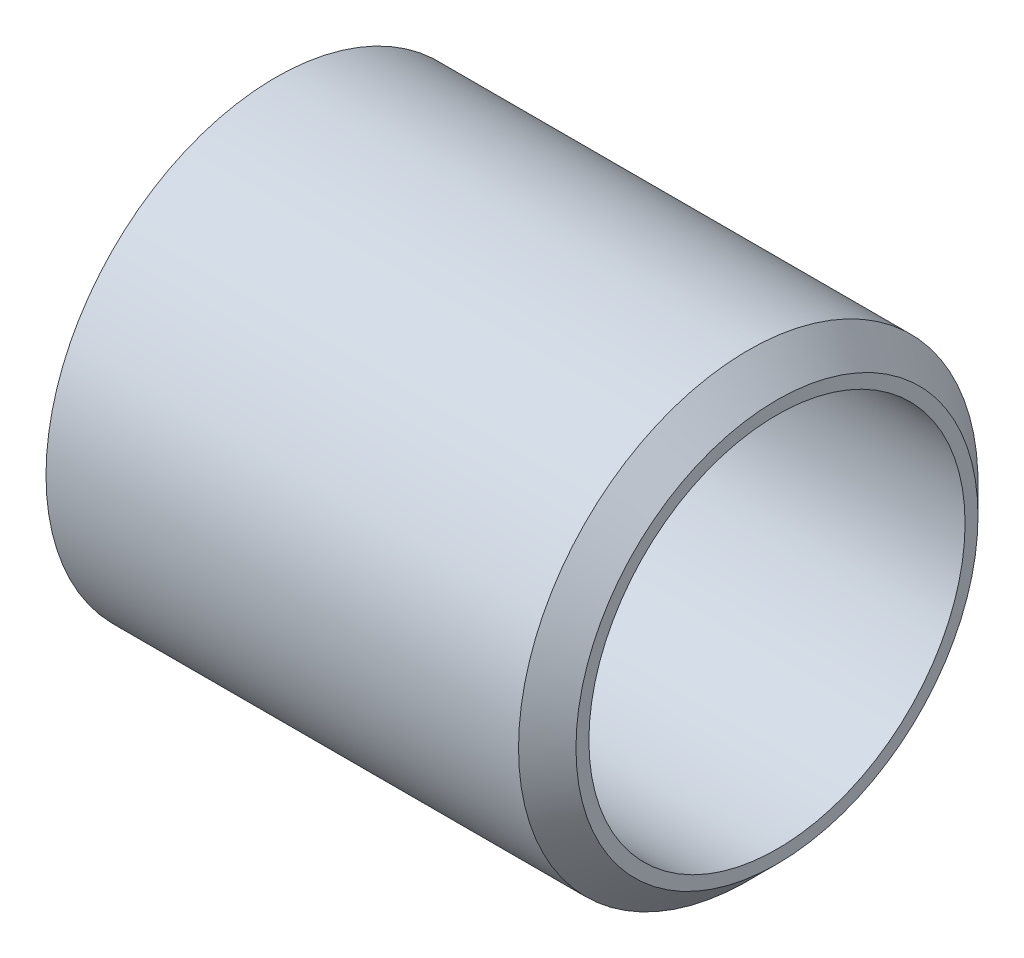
from build123d import *


with BuildPart() as part:
    # Sketch1 → BaseBody (revolve)
    with BuildSketch(Plane.XY, mode=Mode.PRIVATE) as basebody_sk:
        with BuildLine():
            Line((0, 31.76905), (0, 34.925))
            Line((0, 34.925), (71.834375, 34.925))
            Line((71.834375, 34.925), (76.2, 30.559375))
            Line((76.2, 30.559375), (76.2, 28.59405))
            Line((76.2, 28.59405), (3.175, 28.59405))
            ThreePointArc((3.175, 28.59405), (0.92993597, 29.52398597), (0, 31.76905))
        make_face()
    revolve(basebody_sk.sketch.rotate(Axis((0, 0, 0), (1, 0, 0)), 90), axis=Axis((0, 0, 0), (1, 0, 0)))


solid = part.part
